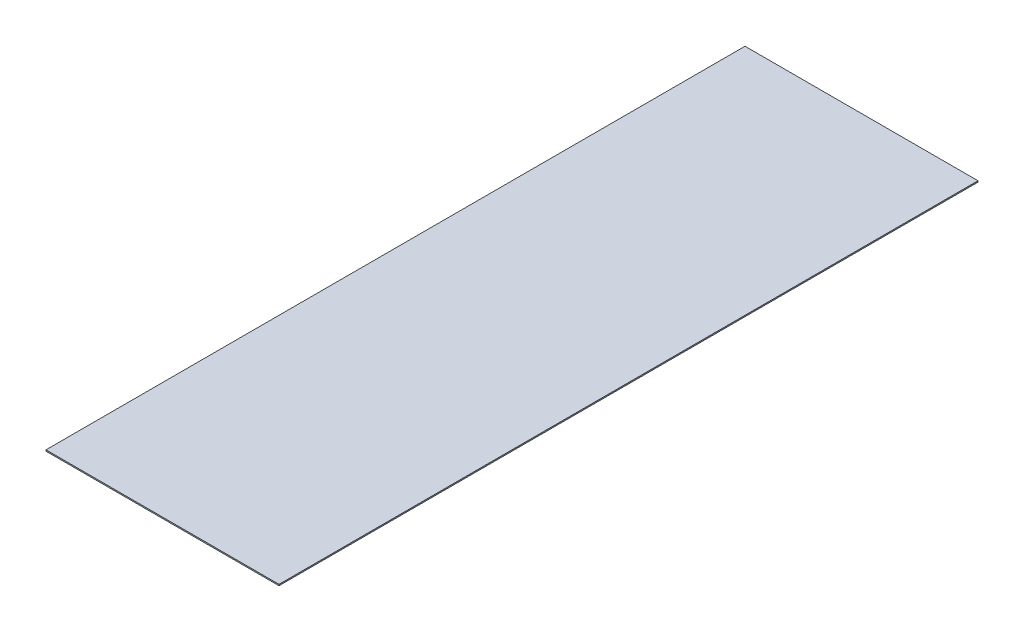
ISO-10303-21;
HEADER;
FILE_DESCRIPTION(('STEP AP214'),'2;1');
FILE_NAME('part.step','',(''),(''),'','','');
FILE_SCHEMA(('AUTOMOTIVE_DESIGN { 1 0 10303 214 1 1 1 1 }'));
ENDSEC;
DATA;
#1=APPLICATION_CONTEXT('core data for automotive mechanical design processes');
#2=APPLICATION_PROTOCOL_DEFINITION('international standard','automotive_design',2000,#1);
#3=PRODUCT_CONTEXT('',#1,'mechanical');
#4=PRODUCT('Part','Part','',(#3));
#5=PRODUCT_RELATED_PRODUCT_CATEGORY('part','',(#4));
#6=PRODUCT_DEFINITION_FORMATION('','',#4);
#7=PRODUCT_DEFINITION_CONTEXT('part definition',#1,'design');
#8=PRODUCT_DEFINITION('design','',#6,#7);
#9=PRODUCT_DEFINITION_SHAPE('','',#8);
#10=(LENGTH_UNIT() NAMED_UNIT(*) SI_UNIT(.MILLI.,.METRE.));
#11=(NAMED_UNIT(*) PLANE_ANGLE_UNIT() SI_UNIT($,.RADIAN.));
#12=(NAMED_UNIT(*) SI_UNIT($,.STERADIAN.) SOLID_ANGLE_UNIT());
#13=UNCERTAINTY_MEASURE_WITH_UNIT(LENGTH_MEASURE(1.E-05),#10,'distance_accuracy_value','');
#14=(GEOMETRIC_REPRESENTATION_CONTEXT(3) GLOBAL_UNCERTAINTY_ASSIGNED_CONTEXT((#13)) GLOBAL_UNIT_ASSIGNED_CONTEXT((#10,
#11,#12)) REPRESENTATION_CONTEXT('',''));
#15=CARTESIAN_POINT('',(0.,0.,0.));
#16=DIRECTION('',(0.,0.,1.));
#17=DIRECTION('',(1.,0.,0.));
#18=AXIS2_PLACEMENT_3D('',#15,#16,#17);
#19=CARTESIAN_POINT('',(0.,0.254,0.));
#20=DIRECTION('',(-1.,0.,0.));
#21=DIRECTION('',(0.,0.,1.));
#22=AXIS2_PLACEMENT_3D('',#19,#20,#21);
#23=PLANE('',#22);
#24=DIRECTION('',(0.,0.,-1.));
#25=VECTOR('',#24,1.);
#26=CARTESIAN_POINT('',(0.,0.,0.));
#27=LINE('',#26,#25);
#28=CARTESIAN_POINT('',(0.,0.,142.875));
#29=VERTEX_POINT('',#28);
#30=CARTESIAN_POINT('',(0.,0.,0.));
#31=VERTEX_POINT('',#30);
#32=EDGE_CURVE('E96',#29,#31,#27,.T.);
#33=ORIENTED_EDGE('',*,*,#32,.T.);
#34=DIRECTION('',(0.,-1.,0.));
#35=VECTOR('',#34,1.);
#36=CARTESIAN_POINT('',(0.,0.254,0.));
#37=LINE('',#36,#35);
#38=CARTESIAN_POINT('',(0.,0.254,0.));
#39=VERTEX_POINT('',#38);
#40=EDGE_CURVE('E11',#39,#31,#37,.T.);
#41=ORIENTED_EDGE('',*,*,#40,.F.);
#42=DIRECTION('',(0.,0.,-1.));
#43=VECTOR('',#42,1.);
#44=CARTESIAN_POINT('',(0.,0.254,0.));
#45=LINE('',#44,#43);
#46=CARTESIAN_POINT('',(0.,0.254,142.875));
#47=VERTEX_POINT('',#46);
#48=EDGE_CURVE('E84',#47,#39,#45,.T.);
#49=ORIENTED_EDGE('',*,*,#48,.F.);
#50=DIRECTION('',(0.,-1.,0.));
#51=VECTOR('',#50,1.);
#52=CARTESIAN_POINT('',(0.,0.254,142.875));
#53=LINE('',#52,#51);
#54=EDGE_CURVE('E92',#47,#29,#53,.T.);
#55=ORIENTED_EDGE('',*,*,#54,.T.);
#56=EDGE_LOOP('',(#33,#41,#49,#55));
#57=FACE_BOUND('',#56,.T.);
#58=ADVANCED_FACE('F33',(#57),#23,.F.);
#59=CARTESIAN_POINT('',(-47.625,0.254,0.));
#60=DIRECTION('',(0.,0.,1.));
#61=DIRECTION('',(1.,0.,0.));
#62=AXIS2_PLACEMENT_3D('',#59,#60,#61);
#63=PLANE('',#62);
#64=DIRECTION('',(-1.,0.,0.));
#65=VECTOR('',#64,1.);
#66=CARTESIAN_POINT('',(-47.625,0.,0.));
#67=LINE('',#66,#65);
#68=CARTESIAN_POINT('',(-47.625,0.,0.));
#69=VERTEX_POINT('',#68);
#70=EDGE_CURVE('E88',#31,#69,#67,.T.);
#71=ORIENTED_EDGE('',*,*,#70,.T.);
#72=DIRECTION('',(0.,-1.,0.));
#73=VECTOR('',#72,1.);
#74=CARTESIAN_POINT('',(-47.625,0.254,0.));
#75=LINE('',#74,#73);
#76=CARTESIAN_POINT('',(-47.625,0.254,0.));
#77=VERTEX_POINT('',#76);
#78=EDGE_CURVE('E41',#77,#69,#75,.T.);
#79=ORIENTED_EDGE('',*,*,#78,.F.);
#80=DIRECTION('',(-1.,0.,0.));
#81=VECTOR('',#80,1.);
#82=CARTESIAN_POINT('',(-47.625,0.254,0.));
#83=LINE('',#82,#81);
#84=EDGE_CURVE('E79',#39,#77,#83,.T.);
#85=ORIENTED_EDGE('',*,*,#84,.F.);
#86=ORIENTED_EDGE('',*,*,#40,.T.);
#87=EDGE_LOOP('',(#71,#79,#85,#86));
#88=FACE_BOUND('',#87,.T.);
#89=ADVANCED_FACE('F87',(#88),#63,.F.);
#90=CARTESIAN_POINT('',(-47.625,0.254,0.));
#91=DIRECTION('',(1.,0.,0.));
#92=DIRECTION('',(0.,0.,-1.));
#93=AXIS2_PLACEMENT_3D('',#90,#91,#92);
#94=PLANE('',#93);
#95=DIRECTION('',(0.,0.,1.));
#96=VECTOR('',#95,1.);
#97=CARTESIAN_POINT('',(-47.625,0.,0.));
#98=LINE('',#97,#96);
#99=CARTESIAN_POINT('',(-47.625,0.,142.875));
#100=VERTEX_POINT('',#99);
#101=EDGE_CURVE('E66',#69,#100,#98,.T.);
#102=ORIENTED_EDGE('',*,*,#101,.T.);
#103=DIRECTION('',(0.,-1.,0.));
#104=VECTOR('',#103,1.);
#105=CARTESIAN_POINT('',(-47.625,0.254,142.875));
#106=LINE('',#105,#104);
#107=CARTESIAN_POINT('',(-47.625,0.254,142.875));
#108=VERTEX_POINT('',#107);
#109=EDGE_CURVE('E89',#108,#100,#106,.T.);
#110=ORIENTED_EDGE('',*,*,#109,.F.);
#111=DIRECTION('',(0.,0.,1.));
#112=VECTOR('',#111,1.);
#113=CARTESIAN_POINT('',(-47.625,0.254,0.));
#114=LINE('',#113,#112);
#115=EDGE_CURVE('E82',#77,#108,#114,.T.);
#116=ORIENTED_EDGE('',*,*,#115,.F.);
#117=ORIENTED_EDGE('',*,*,#78,.T.);
#118=EDGE_LOOP('',(#102,#110,#116,#117));
#119=FACE_BOUND('',#118,.T.);
#120=ADVANCED_FACE('F90',(#119),#94,.F.);
#121=CARTESIAN_POINT('',(0.,0.254,142.875));
#122=DIRECTION('',(0.,0.,-1.));
#123=DIRECTION('',(-1.,0.,0.));
#124=AXIS2_PLACEMENT_3D('',#121,#122,#123);
#125=PLANE('',#124);
#126=DIRECTION('',(1.,0.,0.));
#127=VECTOR('',#126,1.);
#128=CARTESIAN_POINT('',(0.,0.,142.875));
#129=LINE('',#128,#127);
#130=EDGE_CURVE('E72',#100,#29,#129,.T.);
#131=ORIENTED_EDGE('',*,*,#130,.T.);
#132=ORIENTED_EDGE('',*,*,#54,.F.);
#133=DIRECTION('',(1.,0.,0.));
#134=VECTOR('',#133,1.);
#135=CARTESIAN_POINT('',(0.,0.254,142.875));
#136=LINE('',#135,#134);
#137=EDGE_CURVE('E49',#108,#47,#136,.T.);
#138=ORIENTED_EDGE('',*,*,#137,.F.);
#139=ORIENTED_EDGE('',*,*,#109,.T.);
#140=EDGE_LOOP('',(#131,#132,#138,#139));
#141=FACE_BOUND('',#140,.T.);
#142=ADVANCED_FACE('F103',(#141),#125,.F.);
#143=CARTESIAN_POINT('',(0.,0.254,142.875));
#144=DIRECTION('',(0.,-1.,0.));
#145=DIRECTION('',(0.,0.,-1.));
#146=AXIS2_PLACEMENT_3D('',#143,#144,#145);
#147=PLANE('',#146);
#148=ORIENTED_EDGE('',*,*,#48,.T.);
#149=ORIENTED_EDGE('',*,*,#84,.T.);
#150=ORIENTED_EDGE('',*,*,#115,.T.);
#151=ORIENTED_EDGE('',*,*,#137,.T.);
#152=EDGE_LOOP('',(#148,#149,#150,#151));
#153=FACE_BOUND('',#152,.T.);
#154=ADVANCED_FACE('F80',(#153),#147,.F.);
#155=CARTESIAN_POINT('',(0.,0.,142.875));
#156=DIRECTION('',(0.,-1.,0.));
#157=DIRECTION('',(0.,0.,-1.));
#158=AXIS2_PLACEMENT_3D('',#155,#156,#157);
#159=PLANE('',#158);
#160=ORIENTED_EDGE('',*,*,#32,.F.);
#161=ORIENTED_EDGE('',*,*,#130,.F.);
#162=ORIENTED_EDGE('',*,*,#101,.F.);
#163=ORIENTED_EDGE('',*,*,#70,.F.);
#164=EDGE_LOOP('',(#160,#161,#162,#163));
#165=FACE_BOUND('',#164,.T.);
#166=ADVANCED_FACE('F106',(#165),#159,.T.);
#167=CLOSED_SHELL('',(#58,#89,#120,#142,#154,#166));
#168=MANIFOLD_SOLID_BREP('B2',#167);
#169=ADVANCED_BREP_SHAPE_REPRESENTATION('',(#18,#168),#14);
#170=SHAPE_DEFINITION_REPRESENTATION(#9,#169);
ENDSEC;
END-ISO-10303-21;
